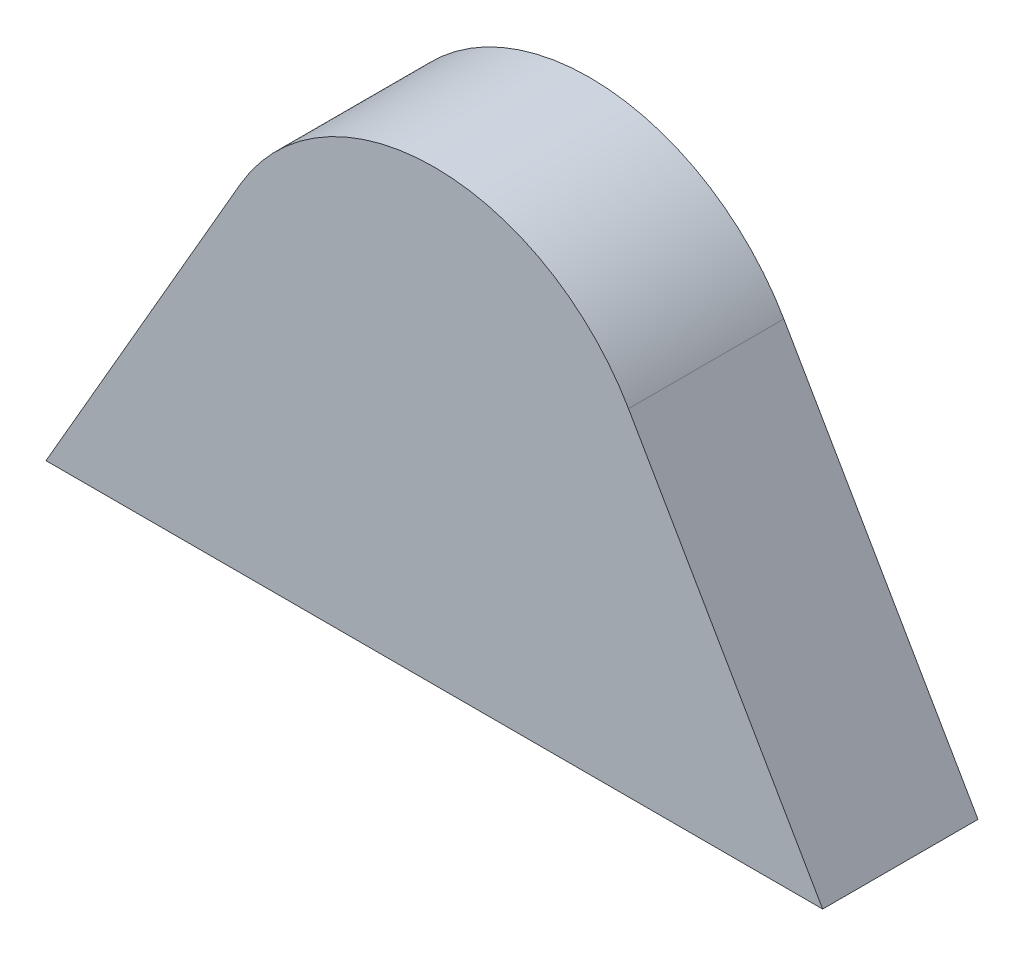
ISO-10303-21;
HEADER;
FILE_DESCRIPTION(('STEP AP214'),'2;1');
FILE_NAME('part.step','',(''),(''),'','','');
FILE_SCHEMA(('AUTOMOTIVE_DESIGN { 1 0 10303 214 1 1 1 1 }'));
ENDSEC;
DATA;
#1=APPLICATION_CONTEXT('core data for automotive mechanical design processes');
#2=APPLICATION_PROTOCOL_DEFINITION('international standard','automotive_design',2000,#1);
#3=PRODUCT_CONTEXT('',#1,'mechanical');
#4=PRODUCT('Part','Part','',(#3));
#5=PRODUCT_RELATED_PRODUCT_CATEGORY('part','',(#4));
#6=PRODUCT_DEFINITION_FORMATION('','',#4);
#7=PRODUCT_DEFINITION_CONTEXT('part definition',#1,'design');
#8=PRODUCT_DEFINITION('design','',#6,#7);
#9=PRODUCT_DEFINITION_SHAPE('','',#8);
#10=(LENGTH_UNIT() NAMED_UNIT(*) SI_UNIT(.MILLI.,.METRE.));
#11=(NAMED_UNIT(*) PLANE_ANGLE_UNIT() SI_UNIT($,.RADIAN.));
#12=(NAMED_UNIT(*) SI_UNIT($,.STERADIAN.) SOLID_ANGLE_UNIT());
#13=UNCERTAINTY_MEASURE_WITH_UNIT(LENGTH_MEASURE(1.E-05),#10,'distance_accuracy_value','');
#14=(GEOMETRIC_REPRESENTATION_CONTEXT(3) GLOBAL_UNCERTAINTY_ASSIGNED_CONTEXT((#13)) GLOBAL_UNIT_ASSIGNED_CONTEXT((#10,
#11,#12)) REPRESENTATION_CONTEXT('',''));
#15=CARTESIAN_POINT('',(0.,0.,0.));
#16=DIRECTION('',(0.,0.,1.));
#17=DIRECTION('',(1.,0.,0.));
#18=AXIS2_PLACEMENT_3D('',#15,#16,#17);
#19=CARTESIAN_POINT('',(25.,0.,10.));
#20=DIRECTION('',(0.,1.,0.));
#21=DIRECTION('',(0.,0.,1.));
#22=AXIS2_PLACEMENT_3D('',#19,#20,#21);
#23=PLANE('',#22);
#24=DIRECTION('',(1.,0.,0.));
#25=VECTOR('',#24,1.);
#26=CARTESIAN_POINT('',(25.,0.,0.));
#27=LINE('',#26,#25);
#28=CARTESIAN_POINT('',(0.,0.,0.));
#29=VERTEX_POINT('',#28);
#30=CARTESIAN_POINT('',(50.,0.,0.));
#31=VERTEX_POINT('',#30);
#32=EDGE_CURVE('E75',#29,#31,#27,.T.);
#33=ORIENTED_EDGE('',*,*,#32,.T.);
#34=DIRECTION('',(0.,0.,-1.));
#35=VECTOR('',#34,1.);
#36=CARTESIAN_POINT('',(50.,0.,10.));
#37=LINE('',#36,#35);
#38=CARTESIAN_POINT('',(50.,0.,10.));
#39=VERTEX_POINT('',#38);
#40=EDGE_CURVE('E11',#39,#31,#37,.T.);
#41=ORIENTED_EDGE('',*,*,#40,.F.);
#42=DIRECTION('',(1.,0.,0.));
#43=VECTOR('',#42,1.);
#44=CARTESIAN_POINT('',(25.,0.,10.));
#45=LINE('',#44,#43);
#46=CARTESIAN_POINT('',(0.,0.,10.));
#47=VERTEX_POINT('',#46);
#48=EDGE_CURVE('E93',#47,#39,#45,.T.);
#49=ORIENTED_EDGE('',*,*,#48,.F.);
#50=DIRECTION('',(0.,0.,-1.));
#51=VECTOR('',#50,1.);
#52=CARTESIAN_POINT('',(0.,0.,10.));
#53=LINE('',#52,#51);
#54=EDGE_CURVE('E87',#47,#29,#53,.T.);
#55=ORIENTED_EDGE('',*,*,#54,.T.);
#56=EDGE_LOOP('',(#33,#41,#49,#55));
#57=FACE_BOUND('',#56,.T.);
#58=ADVANCED_FACE('F31',(#57),#23,.F.);
#59=CARTESIAN_POINT('',(56.7137833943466,-11.6286139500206,10.));
#60=DIRECTION('',(-0.866025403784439,-0.5,0.));
#61=DIRECTION('',(0.5,-0.866025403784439,0.));
#62=AXIS2_PLACEMENT_3D('',#59,#60,#61);
#63=PLANE('',#62);
#64=DIRECTION('',(-0.5,0.866025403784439,0.));
#65=VECTOR('',#64,1.);
#66=CARTESIAN_POINT('',(56.7137833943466,-11.6286139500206,0.));
#67=LINE('',#66,#65);
#68=CARTESIAN_POINT('',(37.5,21.650635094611,0.));
#69=VERTEX_POINT('',#68);
#70=EDGE_CURVE('E71',#31,#69,#67,.T.);
#71=ORIENTED_EDGE('',*,*,#70,.T.);
#72=DIRECTION('',(0.,0.,-1.));
#73=VECTOR('',#72,1.);
#74=CARTESIAN_POINT('',(37.5,21.650635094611,10.));
#75=LINE('',#74,#73);
#76=CARTESIAN_POINT('',(37.5,21.650635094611,10.));
#77=VERTEX_POINT('',#76);
#78=EDGE_CURVE('E38',#77,#69,#75,.T.);
#79=ORIENTED_EDGE('',*,*,#78,.F.);
#80=DIRECTION('',(-0.5,0.866025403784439,0.));
#81=VECTOR('',#80,1.);
#82=CARTESIAN_POINT('',(56.7137833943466,-11.6286139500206,10.));
#83=LINE('',#82,#81);
#84=EDGE_CURVE('E83',#39,#77,#83,.T.);
#85=ORIENTED_EDGE('',*,*,#84,.F.);
#86=ORIENTED_EDGE('',*,*,#40,.T.);
#87=EDGE_LOOP('',(#71,#79,#85,#86));
#88=FACE_BOUND('',#87,.T.);
#89=ADVANCED_FACE('F82',(#88),#63,.F.);
#90=CARTESIAN_POINT('',(25.,14.4337567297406,10.));
#91=DIRECTION('',(0.,0.,-1.));
#92=DIRECTION('',(-1.,0.,0.));
#93=AXIS2_PLACEMENT_3D('',#90,#91,#92);
#94=CYLINDRICAL_SURFACE('',#93,14.4337567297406);
#95=CARTESIAN_POINT('',(25.,14.4337567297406,0.));
#96=DIRECTION('',(0.,0.,1.));
#97=DIRECTION('',(1.,0.,0.));
#98=AXIS2_PLACEMENT_3D('',#95,#96,#97);
#99=CIRCLE('',#98,14.4337567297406);
#100=CARTESIAN_POINT('',(12.5,21.650635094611,0.));
#101=VERTEX_POINT('',#100);
#102=EDGE_CURVE('E76',#69,#101,#99,.T.);
#103=ORIENTED_EDGE('',*,*,#102,.T.);
#104=DIRECTION('',(0.,0.,-1.));
#105=VECTOR('',#104,1.);
#106=CARTESIAN_POINT('',(12.5,21.650635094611,10.));
#107=LINE('',#106,#105);
#108=CARTESIAN_POINT('',(12.5,21.650635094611,10.));
#109=VERTEX_POINT('',#108);
#110=EDGE_CURVE('E99',#109,#101,#107,.T.);
#111=ORIENTED_EDGE('',*,*,#110,.F.);
#112=CARTESIAN_POINT('',(25.,14.4337567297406,10.));
#113=DIRECTION('',(0.,0.,1.));
#114=DIRECTION('',(1.,0.,0.));
#115=AXIS2_PLACEMENT_3D('',#112,#113,#114);
#116=CIRCLE('',#115,14.4337567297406);
#117=EDGE_CURVE('E50',#77,#109,#116,.T.);
#118=ORIENTED_EDGE('',*,*,#117,.F.);
#119=ORIENTED_EDGE('',*,*,#78,.T.);
#120=EDGE_LOOP('',(#103,#111,#118,#119));
#121=FACE_BOUND('',#120,.T.);
#122=ADVANCED_FACE('F102',(#121),#94,.T.);
#123=CARTESIAN_POINT('',(-6.71378339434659,-11.6286139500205,10.));
#124=DIRECTION('',(0.866025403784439,-0.5,0.));
#125=DIRECTION('',(0.5,0.866025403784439,0.));
#126=AXIS2_PLACEMENT_3D('',#123,#124,#125);
#127=PLANE('',#126);
#128=DIRECTION('',(-0.5,-0.866025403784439,0.));
#129=VECTOR('',#128,1.);
#130=CARTESIAN_POINT('',(-6.71378339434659,-11.6286139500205,0.));
#131=LINE('',#130,#129);
#132=EDGE_CURVE('E91',#101,#29,#131,.T.);
#133=ORIENTED_EDGE('',*,*,#132,.T.);
#134=ORIENTED_EDGE('',*,*,#54,.F.);
#135=DIRECTION('',(-0.5,-0.866025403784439,0.));
#136=VECTOR('',#135,1.);
#137=CARTESIAN_POINT('',(-6.71378339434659,-11.6286139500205,10.));
#138=LINE('',#137,#136);
#139=EDGE_CURVE('E45',#109,#47,#138,.T.);
#140=ORIENTED_EDGE('',*,*,#139,.F.);
#141=ORIENTED_EDGE('',*,*,#110,.T.);
#142=EDGE_LOOP('',(#133,#134,#140,#141));
#143=FACE_BOUND('',#142,.T.);
#144=ADVANCED_FACE('F104',(#143),#127,.F.);
#145=CARTESIAN_POINT('',(25.,-29.938575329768,10.));
#146=DIRECTION('',(0.,0.,1.));
#147=DIRECTION('',(1.,0.,0.));
#148=AXIS2_PLACEMENT_3D('',#145,#146,#147);
#149=PLANE('',#148);
#150=ORIENTED_EDGE('',*,*,#48,.T.);
#151=ORIENTED_EDGE('',*,*,#84,.T.);
#152=ORIENTED_EDGE('',*,*,#117,.T.);
#153=ORIENTED_EDGE('',*,*,#139,.T.);
#154=EDGE_LOOP('',(#150,#151,#152,#153));
#155=FACE_BOUND('',#154,.T.);
#156=ADVANCED_FACE('F105',(#155),#149,.T.);
#157=CARTESIAN_POINT('',(25.,-29.938575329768,0.));
#158=DIRECTION('',(0.,0.,1.));
#159=DIRECTION('',(1.,0.,0.));
#160=AXIS2_PLACEMENT_3D('',#157,#158,#159);
#161=PLANE('',#160);
#162=ORIENTED_EDGE('',*,*,#32,.F.);
#163=ORIENTED_EDGE('',*,*,#132,.F.);
#164=ORIENTED_EDGE('',*,*,#102,.F.);
#165=ORIENTED_EDGE('',*,*,#70,.F.);
#166=EDGE_LOOP('',(#162,#163,#164,#165));
#167=FACE_BOUND('',#166,.T.);
#168=ADVANCED_FACE('F72',(#167),#161,.F.);
#169=CLOSED_SHELL('',(#58,#89,#122,#144,#156,#168));
#170=MANIFOLD_SOLID_BREP('B2',#169);
#171=ADVANCED_BREP_SHAPE_REPRESENTATION('',(#18,#170),#14);
#172=SHAPE_DEFINITION_REPRESENTATION(#9,#171);
ENDSEC;
END-ISO-10303-21;
